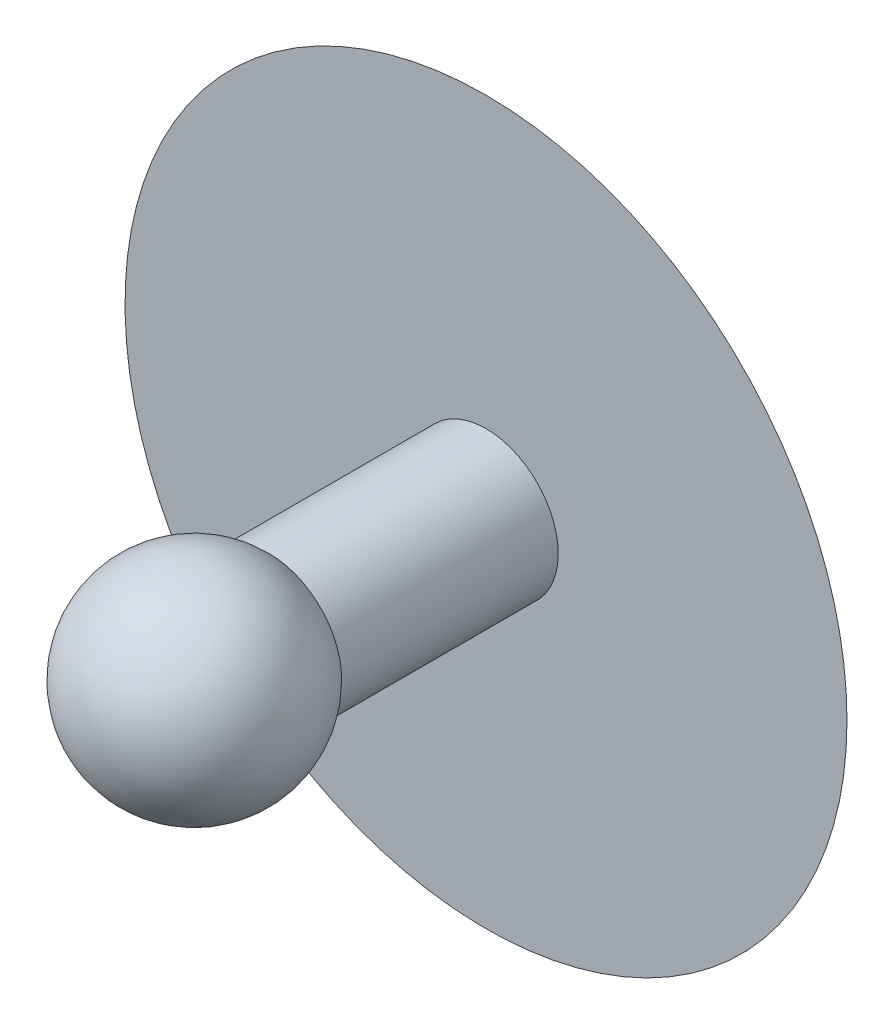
ISO-10303-21;
HEADER;
FILE_DESCRIPTION(('STEP AP214'),'2;1');
FILE_NAME('part.step','',(''),(''),'','','');
FILE_SCHEMA(('AUTOMOTIVE_DESIGN { 1 0 10303 214 1 1 1 1 }'));
ENDSEC;
DATA;
#1=APPLICATION_CONTEXT('core data for automotive mechanical design processes');
#2=APPLICATION_PROTOCOL_DEFINITION('international standard','automotive_design',2000,#1);
#3=PRODUCT_CONTEXT('',#1,'mechanical');
#4=PRODUCT('Part','Part','',(#3));
#5=PRODUCT_RELATED_PRODUCT_CATEGORY('part','',(#4));
#6=PRODUCT_DEFINITION_FORMATION('','',#4);
#7=PRODUCT_DEFINITION_CONTEXT('part definition',#1,'design');
#8=PRODUCT_DEFINITION('design','',#6,#7);
#9=PRODUCT_DEFINITION_SHAPE('','',#8);
#10=(LENGTH_UNIT() NAMED_UNIT(*) SI_UNIT(.MILLI.,.METRE.));
#11=(NAMED_UNIT(*) PLANE_ANGLE_UNIT() SI_UNIT($,.RADIAN.));
#12=(NAMED_UNIT(*) SI_UNIT($,.STERADIAN.) SOLID_ANGLE_UNIT());
#13=UNCERTAINTY_MEASURE_WITH_UNIT(LENGTH_MEASURE(1.E-05),#10,'distance_accuracy_value','');
#14=(GEOMETRIC_REPRESENTATION_CONTEXT(3) GLOBAL_UNCERTAINTY_ASSIGNED_CONTEXT((#13)) GLOBAL_UNIT_ASSIGNED_CONTEXT((#10,
#11,#12)) REPRESENTATION_CONTEXT('',''));
#15=CARTESIAN_POINT('',(0.,0.,0.));
#16=DIRECTION('',(0.,0.,1.));
#17=DIRECTION('',(1.,0.,0.));
#18=AXIS2_PLACEMENT_3D('',#15,#16,#17);
#19=CARTESIAN_POINT('',(0.,0.,2.02046855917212));
#20=DIRECTION('',(0.,0.,1.));
#21=DIRECTION('',(0.,1.,0.));
#22=AXIS2_PLACEMENT_3D('',#19,#20,#21);
#23=SPHERICAL_SURFACE('',#22,0.721725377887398);
#24=CARTESIAN_POINT('',(0.,0.,1.5));
#25=DIRECTION('',(0.,0.,1.));
#26=DIRECTION('',(1.,0.,0.));
#27=AXIS2_PLACEMENT_3D('',#24,#25,#26);
#28=CIRCLE('',#27,0.5);
#29=CARTESIAN_POINT('',(0.5,0.,1.5));
#30=VERTEX_POINT('',#29);
#31=EDGE_CURVE('E10',#30,#30,#28,.T.);
#32=ORIENTED_EDGE('',*,*,#31,.T.);
#33=EDGE_LOOP('',(#32));
#34=FACE_BOUND('',#33,.T.);
#35=ADVANCED_FACE('F29',(#34),#23,.T.);
#36=CARTESIAN_POINT('',(0.,0.,3.67536927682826));
#37=DIRECTION('',(0.,0.,1.));
#38=DIRECTION('',(1.,0.,0.));
#39=AXIS2_PLACEMENT_3D('',#36,#37,#38);
#40=CYLINDRICAL_SURFACE('',#39,0.5);
#41=ORIENTED_EDGE('',*,*,#31,.F.);
#42=EDGE_LOOP('',(#41));
#43=FACE_BOUND('',#42,.T.);
#44=CARTESIAN_POINT('',(0.,0.,0.));
#45=DIRECTION('',(0.,0.,1.));
#46=DIRECTION('',(1.,0.,0.));
#47=AXIS2_PLACEMENT_3D('',#44,#45,#46);
#48=CIRCLE('',#47,0.5);
#49=CARTESIAN_POINT('',(0.5,0.,0.));
#50=VERTEX_POINT('',#49);
#51=EDGE_CURVE('E35',#50,#50,#48,.T.);
#52=ORIENTED_EDGE('',*,*,#51,.T.);
#53=EDGE_LOOP('',(#52));
#54=FACE_BOUND('',#53,.T.);
#55=ADVANCED_FACE('F54',(#43,#54),#40,.T.);
#56=CARTESIAN_POINT('',(0.,0.5,0.));
#57=DIRECTION('',(0.,0.,-1.));
#58=DIRECTION('',(-1.,0.,0.));
#59=AXIS2_PLACEMENT_3D('',#56,#57,#58);
#60=PLANE('',#59);
#61=ORIENTED_EDGE('',*,*,#51,.F.);
#62=EDGE_LOOP('',(#61));
#63=FACE_BOUND('',#62,.T.);
#64=CARTESIAN_POINT('',(0.,0.,0.));
#65=DIRECTION('',(0.,0.,1.));
#66=DIRECTION('',(1.,0.,0.));
#67=AXIS2_PLACEMENT_3D('',#64,#65,#66);
#68=CIRCLE('',#67,2.5);
#69=CARTESIAN_POINT('',(2.5,0.,0.));
#70=VERTEX_POINT('',#69);
#71=EDGE_CURVE('E39',#70,#70,#68,.T.);
#72=ORIENTED_EDGE('',*,*,#71,.T.);
#73=EDGE_LOOP('',(#72));
#74=FACE_BOUND('',#73,.T.);
#75=ADVANCED_FACE('F46',(#63,#74),#60,.F.);
#76=CARTESIAN_POINT('',(0.,0.,20.7583333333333));
#77=DIRECTION('',(0.,0.,1.));
#78=DIRECTION('',(0.,1.,0.));
#79=AXIS2_PLACEMENT_3D('',#76,#77,#78);
#80=SPHERICAL_SURFACE('',#79,20.9083333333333);
#81=ORIENTED_EDGE('',*,*,#71,.F.);
#82=EDGE_LOOP('',(#81));
#83=FACE_BOUND('',#82,.T.);
#84=ADVANCED_FACE('F48',(#83),#80,.T.);
#85=CLOSED_SHELL('',(#35,#55,#75,#84));
#86=MANIFOLD_SOLID_BREP('B2',#85);
#87=ADVANCED_BREP_SHAPE_REPRESENTATION('',(#18,#86),#14);
#88=SHAPE_DEFINITION_REPRESENTATION(#9,#87);
ENDSEC;
END-ISO-10303-21;
